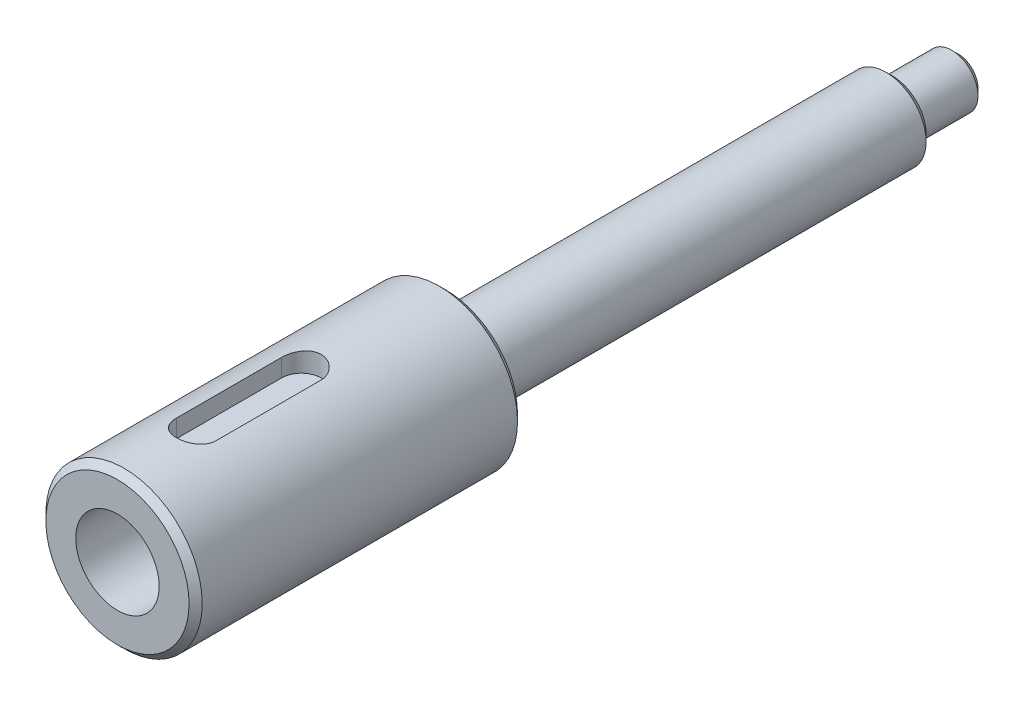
from build123d import *

# Parameters (mm, degrees)
SKETCH1_R                          = 5.95
BASE_EXTRUDE_DEPTH                 = 25
SKETCH3_R                          = 3.05
BOSS_EXTRUDE1_DEPTH                = 39
CHAMFER1_SIZE                      = 0.5
CUT_EXTRUDE2_DEPTH                 = 1.6
M6_0_6_000000_DIAMETER_HOLE1_D     = 6.35
M6_0_6_000000_DIAMETER_HOLE1_DEPTH = 21.5
M6_0_6_000000_DIAMETER_HOLE1_TIP   = 1.907732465
CUT_EXTRUDE3_START                 = -5
SKETCH10_R                         = 3.05
SKETCH10_R_2                       = 2
CUT_EXTRUDE3_DEPTH                 = 5
CHAMFER2_SIZE                      = 0.5
SKETCH11_R                         = 0.75
CUT_EXTRUDE4_DEPTH                 = 10


with BuildPart() as part:
    # Sketch1 → Base-Extrude (new body)
    with BuildSketch(Plane.XY):
        Circle(SKETCH1_R)
    extrude(amount=BASE_EXTRUDE_DEPTH)

    # Sketch3 → Boss-Extrude1 (add)
    with BuildSketch(Plane(origin=(0, 0, 0), x_dir=(-1, 0, 0), z_dir=(0, 0, -1))):
        with Locations(Location((0, 0, 0), (0, 0, 180))):
            Circle(SKETCH3_R)
    extrude(amount=BOSS_EXTRUDE1_DEPTH)

    # Chamfer1
    chamfer1_edges = [part.edges().sort_by_distance(p)[0] for p in [
        (-5.95, 0, 0),
        (-5.95, 0, 25),
    ]]
    chamfer(chamfer1_edges, length=CHAMFER1_SIZE)

    # Sketch7 → Cut-Extrude2 (cut)
    with BuildSketch(Plane(origin=(0, 6, 0), x_dir=(-1, 0, 0), z_dir=(0, 1, 0))):
        with BuildLine():
            Line((-1.5, 19), (-1.5, 11))
            ThreePointArc((-1.5, 11), (0, 9.5), (1.5, 11))
            Line((1.5, 11), (1.5, 19))
            ThreePointArc((1.5, 19), (0, 20.5), (-1.5, 19))
        make_face()
    extrude(amount=-CUT_EXTRUDE2_DEPTH, mode=Mode.SUBTRACT)

    # M6.0 _6.000000_ Diameter Hole1
    with Locations(Plane.XY.offset(25)):
        with Locations((0, 0)):
            Hole(M6_0_6_000000_DIAMETER_HOLE1_D / 2, depth=M6_0_6_000000_DIAMETER_HOLE1_DEPTH)
            with Locations((0, 0, -(M6_0_6_000000_DIAMETER_HOLE1_DEPTH + M6_0_6_000000_DIAMETER_HOLE1_TIP / 2))):  # 118° drill point
                Cone(0, M6_0_6_000000_DIAMETER_HOLE1_D / 2, M6_0_6_000000_DIAMETER_HOLE1_TIP, mode=Mode.SUBTRACT)

    # Sketch10 → Cut-Extrude3 (cut)
    with BuildSketch(Plane(origin=(0, 0, -39), x_dir=(-1, 0, 0), z_dir=(0, 0, -1)).offset(CUT_EXTRUDE3_START)):
        with Locations(Location((0, 0, 0), (0, 0, 180))):
            Circle(SKETCH10_R)
        Circle(SKETCH10_R_2, mode=Mode.SUBTRACT)
    extrude(amount=CUT_EXTRUDE3_DEPTH, mode=Mode.SUBTRACT)

    # Chamfer2
    chamfer2_edges = [part.edges().sort_by_distance(p)[0] for p in [
        (-3.05, 0, -34),
        (2, 0, -39),
    ]]
    chamfer(chamfer2_edges, length=CHAMFER2_SIZE)

    # Sketch11 → Cut-Extrude4 (cut)
    with BuildSketch(Plane(origin=(0, 0, 0), x_dir=(0, 0, -1), z_dir=(1, 0, 0))):
        with Locations(Location((-2.75, 0, 0), (0, 0, 179.999999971))):
            Circle(SKETCH11_R)
    extrude(amount=-CUT_EXTRUDE4_DEPTH, mode=Mode.SUBTRACT)


solid = part.part
